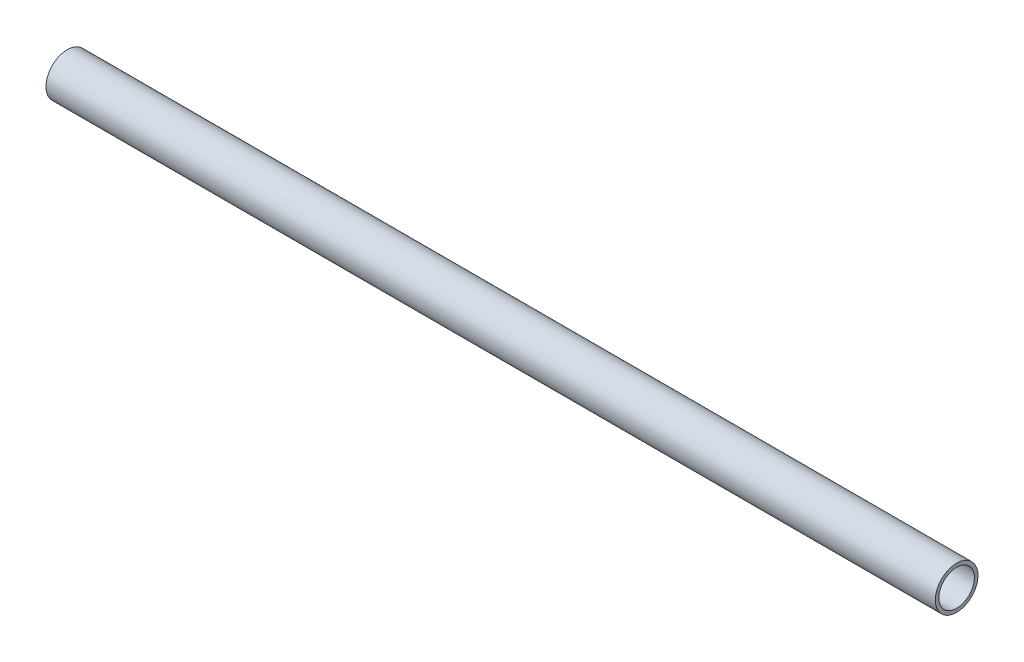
from build123d import *

# Parameters (mm, degrees)
SKETCH1_R      = 120
SKETCH1_R_2    = 100
EXTRUDE1_DEPTH = 5000


with BuildPart() as part:
    # Sketch1 → Extrude1 (new body)
    with BuildSketch(Plane(origin=(0, 0, 0), x_dir=(0, 0, -1), z_dir=(1, 0, 0))):
        Circle(SKETCH1_R)
        Circle(SKETCH1_R_2, mode=Mode.SUBTRACT)
    extrude(amount=EXTRUDE1_DEPTH)


solid = part.part
